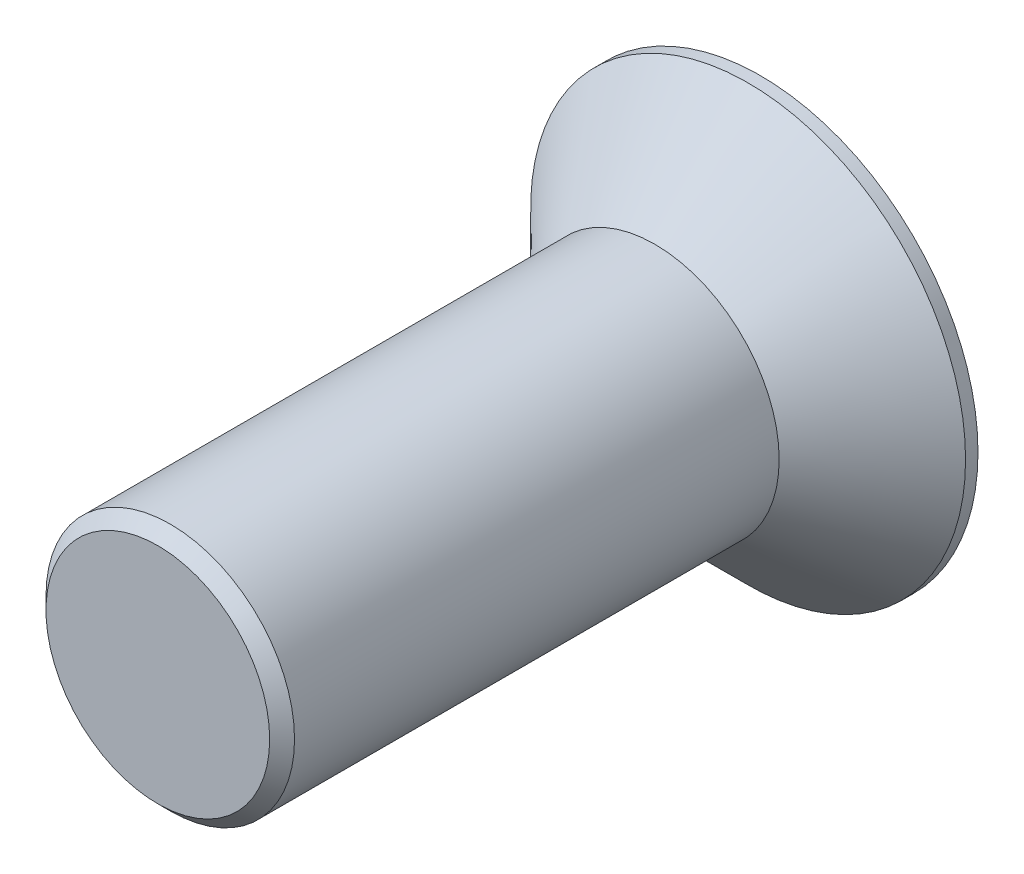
ISO-10303-21;
HEADER;
FILE_DESCRIPTION(('STEP AP214'),'2;1');
FILE_NAME('part.step','',(''),(''),'','','');
FILE_SCHEMA(('AUTOMOTIVE_DESIGN { 1 0 10303 214 1 1 1 1 }'));
ENDSEC;
DATA;
#1=APPLICATION_CONTEXT('core data for automotive mechanical design processes');
#2=APPLICATION_PROTOCOL_DEFINITION('international standard','automotive_design',2000,#1);
#3=PRODUCT_CONTEXT('',#1,'mechanical');
#4=PRODUCT('Part','Part','',(#3));
#5=PRODUCT_RELATED_PRODUCT_CATEGORY('part','',(#4));
#6=PRODUCT_DEFINITION_FORMATION('','',#4);
#7=PRODUCT_DEFINITION_CONTEXT('part definition',#1,'design');
#8=PRODUCT_DEFINITION('design','',#6,#7);
#9=PRODUCT_DEFINITION_SHAPE('','',#8);
#10=(LENGTH_UNIT() NAMED_UNIT(*) SI_UNIT(.MILLI.,.METRE.));
#11=(NAMED_UNIT(*) PLANE_ANGLE_UNIT() SI_UNIT($,.RADIAN.));
#12=(NAMED_UNIT(*) SI_UNIT($,.STERADIAN.) SOLID_ANGLE_UNIT());
#13=UNCERTAINTY_MEASURE_WITH_UNIT(LENGTH_MEASURE(1.E-05),#10,'distance_accuracy_value','');
#14=(GEOMETRIC_REPRESENTATION_CONTEXT(3) GLOBAL_UNCERTAINTY_ASSIGNED_CONTEXT((#13)) GLOBAL_UNIT_ASSIGNED_CONTEXT((#10,
#11,#12)) REPRESENTATION_CONTEXT('',''));
#15=CARTESIAN_POINT('',(0.,0.,0.));
#16=DIRECTION('',(0.,0.,1.));
#17=DIRECTION('',(1.,0.,0.));
#18=AXIS2_PLACEMENT_3D('',#15,#16,#17);
#19=CARTESIAN_POINT('',(0.,0.,8.));
#20=DIRECTION('',(0.,0.,-1.));
#21=DIRECTION('',(-1.,0.,0.));
#22=AXIS2_PLACEMENT_3D('',#19,#20,#21);
#23=CYLINDRICAL_SURFACE('',#22,2.);
#24=CARTESIAN_POINT('',(0.,0.,7.8));
#25=DIRECTION('',(0.,0.,1.));
#26=DIRECTION('',(1.,0.,0.));
#27=AXIS2_PLACEMENT_3D('',#24,#25,#26);
#28=CIRCLE('',#27,2.);
#29=CARTESIAN_POINT('',(2.,0.,7.8));
#30=VERTEX_POINT('',#29);
#31=EDGE_CURVE('E11',#30,#30,#28,.F.);
#32=ORIENTED_EDGE('',*,*,#31,.T.);
#33=EDGE_LOOP('',(#32));
#34=FACE_BOUND('',#33,.T.);
#35=CARTESIAN_POINT('',(0.,0.,0.));
#36=DIRECTION('',(0.,0.,1.));
#37=DIRECTION('',(1.,0.,0.));
#38=AXIS2_PLACEMENT_3D('',#35,#36,#37);
#39=CIRCLE('',#38,2.);
#40=CARTESIAN_POINT('',(2.,0.,0.));
#41=VERTEX_POINT('',#40);
#42=EDGE_CURVE('E119',#41,#41,#39,.T.);
#43=ORIENTED_EDGE('',*,*,#42,.T.);
#44=EDGE_LOOP('',(#43));
#45=FACE_BOUND('',#44,.T.);
#46=ADVANCED_FACE('F35',(#34,#45),#23,.T.);
#47=CARTESIAN_POINT('',(0.,0.,8.));
#48=DIRECTION('',(0.,0.,1.));
#49=DIRECTION('',(1.,0.,0.));
#50=AXIS2_PLACEMENT_3D('',#47,#48,#49);
#51=PLANE('',#50);
#52=CARTESIAN_POINT('',(0.,0.,8.));
#53=DIRECTION('',(0.,0.,1.));
#54=DIRECTION('',(1.,0.,0.));
#55=AXIS2_PLACEMENT_3D('',#52,#53,#54);
#56=CIRCLE('',#55,1.8);
#57=CARTESIAN_POINT('',(1.8,0.,8.));
#58=VERTEX_POINT('',#57);
#59=EDGE_CURVE('E43',#58,#58,#56,.T.);
#60=ORIENTED_EDGE('',*,*,#59,.T.);
#61=EDGE_LOOP('',(#60));
#62=FACE_BOUND('',#61,.T.);
#63=ADVANCED_FACE('F124',(#62),#51,.T.);
#64=CARTESIAN_POINT('',(0.,0.,8.));
#65=DIRECTION('',(0.,0.,-1.));
#66=DIRECTION('',(-1.,0.,0.));
#67=AXIS2_PLACEMENT_3D('',#64,#65,#66);
#68=CONICAL_SURFACE('',#67,1.8,0.785398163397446);
#69=ORIENTED_EDGE('',*,*,#31,.F.);
#70=EDGE_LOOP('',(#69));
#71=FACE_BOUND('',#70,.T.);
#72=ORIENTED_EDGE('',*,*,#59,.F.);
#73=EDGE_LOOP('',(#72));
#74=FACE_BOUND('',#73,.T.);
#75=ADVANCED_FACE('F37',(#71,#74),#68,.T.);
#76=CARTESIAN_POINT('',(0.,0.,-1.49999999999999));
#77=DIRECTION('',(0.,0.,-1.));
#78=DIRECTION('',(-1.,0.,0.));
#79=AXIS2_PLACEMENT_3D('',#76,#77,#78);
#80=CONICAL_SURFACE('',#79,3.5,0.78539816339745);
#81=ORIENTED_EDGE('',*,*,#42,.F.);
#82=EDGE_LOOP('',(#81));
#83=FACE_BOUND('',#82,.T.);
#84=CARTESIAN_POINT('',(0.,0.,-1.49999999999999));
#85=DIRECTION('',(0.,0.,1.));
#86=DIRECTION('',(1.,0.,0.));
#87=AXIS2_PLACEMENT_3D('',#84,#85,#86);
#88=CIRCLE('',#87,3.5);
#89=CARTESIAN_POINT('',(3.5,0.,-1.49999999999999));
#90=VERTEX_POINT('',#89);
#91=EDGE_CURVE('E116',#90,#90,#88,.T.);
#92=ORIENTED_EDGE('',*,*,#91,.T.);
#93=EDGE_LOOP('',(#92));
#94=FACE_BOUND('',#93,.T.);
#95=ADVANCED_FACE('F127',(#83,#94),#80,.T.);
#96=CARTESIAN_POINT('',(0.,0.,0.));
#97=DIRECTION('',(0.,0.,1.));
#98=DIRECTION('',(1.,0.,0.));
#99=AXIS2_PLACEMENT_3D('',#96,#97,#98);
#100=CYLINDRICAL_SURFACE('',#99,3.5);
#101=ORIENTED_EDGE('',*,*,#91,.F.);
#102=EDGE_LOOP('',(#101));
#103=FACE_BOUND('',#102,.T.);
#104=CARTESIAN_POINT('',(0.,0.,-1.69999999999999));
#105=DIRECTION('',(0.,0.,1.));
#106=DIRECTION('',(1.,0.,0.));
#107=AXIS2_PLACEMENT_3D('',#104,#105,#106);
#108=CIRCLE('',#107,3.5);
#109=CARTESIAN_POINT('',(3.5,0.,-1.69999999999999));
#110=VERTEX_POINT('',#109);
#111=EDGE_CURVE('E111',#110,#110,#108,.T.);
#112=ORIENTED_EDGE('',*,*,#111,.T.);
#113=EDGE_LOOP('',(#112));
#114=FACE_BOUND('',#113,.T.);
#115=ADVANCED_FACE('F133',(#103,#114),#100,.T.);
#116=CARTESIAN_POINT('',(-3.5,0.,-1.69999999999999));
#117=DIRECTION('',(0.,0.,1.));
#118=DIRECTION('',(1.,0.,0.));
#119=AXIS2_PLACEMENT_3D('',#116,#117,#118);
#120=PLANE('',#119);
#121=DIRECTION('',(1.,0.,0.));
#122=VECTOR('',#121,1.);
#123=CARTESIAN_POINT('',(0.25,3.10019943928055,-1.69999999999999));
#124=LINE('',#123,#122);
#125=CARTESIAN_POINT('',(-0.249999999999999,3.10019943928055,-1.69999999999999));
#126=VERTEX_POINT('',#125);
#127=CARTESIAN_POINT('',(0.25,3.10019943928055,-1.69999999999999));
#128=VERTEX_POINT('',#127);
#129=EDGE_CURVE('E85',#126,#128,#124,.T.);
#130=ORIENTED_EDGE('',*,*,#129,.F.);
#131=DIRECTION('',(0.,1.,0.));
#132=VECTOR('',#131,1.);
#133=CARTESIAN_POINT('',(-0.25,3.10019943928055,-1.69999999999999));
#134=LINE('',#133,#132);
#135=CARTESIAN_POINT('',(-0.25,-3.10019943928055,-1.69999999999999));
#136=VERTEX_POINT('',#135);
#137=EDGE_CURVE('E50',#136,#126,#134,.T.);
#138=ORIENTED_EDGE('',*,*,#137,.F.);
#139=DIRECTION('',(-1.,0.,0.));
#140=VECTOR('',#139,1.);
#141=CARTESIAN_POINT('',(0.25,-3.10019943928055,-1.69999999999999));
#142=LINE('',#141,#140);
#143=CARTESIAN_POINT('',(0.25,-3.10019943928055,-1.69999999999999));
#144=VERTEX_POINT('',#143);
#145=EDGE_CURVE('E101',#144,#136,#142,.T.);
#146=ORIENTED_EDGE('',*,*,#145,.F.);
#147=DIRECTION('',(0.,-1.,0.));
#148=VECTOR('',#147,1.);
#149=CARTESIAN_POINT('',(0.25,3.10019943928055,-1.69999999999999));
#150=LINE('',#149,#148);
#151=EDGE_CURVE('E107',#128,#144,#150,.T.);
#152=ORIENTED_EDGE('',*,*,#151,.F.);
#153=EDGE_LOOP('',(#130,#138,#146,#152));
#154=FACE_BOUND('',#153,.T.);
#155=ORIENTED_EDGE('',*,*,#111,.F.);
#156=EDGE_LOOP('',(#155));
#157=FACE_BOUND('',#156,.T.);
#158=ADVANCED_FACE('F146',(#154,#157),#120,.F.);
#159=CARTESIAN_POINT('',(-0.25,3.10019943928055,-1.19999999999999));
#160=DIRECTION('',(-1.,0.,0.));
#161=DIRECTION('',(0.,-1.,0.));
#162=AXIS2_PLACEMENT_3D('',#159,#160,#161);
#163=PLANE('',#162);
#164=ORIENTED_EDGE('',*,*,#137,.T.);
#165=DIRECTION('',(0.,0.,-1.));
#166=VECTOR('',#165,1.);
#167=CARTESIAN_POINT('',(-0.25,3.10019943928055,-1.19999999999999));
#168=LINE('',#167,#166);
#169=CARTESIAN_POINT('',(-0.25,3.10019943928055,-1.19999999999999));
#170=VERTEX_POINT('',#169);
#171=EDGE_CURVE('E73',#170,#126,#168,.T.);
#172=ORIENTED_EDGE('',*,*,#171,.F.);
#173=DIRECTION('',(0.,1.,0.));
#174=VECTOR('',#173,1.);
#175=CARTESIAN_POINT('',(-0.25,3.10019943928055,-1.19999999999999));
#176=LINE('',#175,#174);
#177=CARTESIAN_POINT('',(-0.25,-3.10019943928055,-1.19999999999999));
#178=VERTEX_POINT('',#177);
#179=EDGE_CURVE('E99',#178,#170,#176,.T.);
#180=ORIENTED_EDGE('',*,*,#179,.F.);
#181=DIRECTION('',(0.,0.,-1.));
#182=VECTOR('',#181,1.);
#183=CARTESIAN_POINT('',(-0.25,-3.10019943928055,-1.19999999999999));
#184=LINE('',#183,#182);
#185=EDGE_CURVE('E58',#178,#136,#184,.T.);
#186=ORIENTED_EDGE('',*,*,#185,.T.);
#187=EDGE_LOOP('',(#164,#172,#180,#186));
#188=FACE_BOUND('',#187,.T.);
#189=ADVANCED_FACE('F150',(#188),#163,.F.);
#190=CARTESIAN_POINT('',(0.25,-3.10019943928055,-1.19999999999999));
#191=DIRECTION('',(0.,-1.,0.));
#192=DIRECTION('',(0.,0.,-1.));
#193=AXIS2_PLACEMENT_3D('',#190,#191,#192);
#194=PLANE('',#193);
#195=ORIENTED_EDGE('',*,*,#145,.T.);
#196=ORIENTED_EDGE('',*,*,#185,.F.);
#197=DIRECTION('',(-1.,0.,0.));
#198=VECTOR('',#197,1.);
#199=CARTESIAN_POINT('',(0.25,-3.10019943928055,-1.19999999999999));
#200=LINE('',#199,#198);
#201=CARTESIAN_POINT('',(0.25,-3.10019943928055,-1.19999999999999));
#202=VERTEX_POINT('',#201);
#203=EDGE_CURVE('E96',#202,#178,#200,.T.);
#204=ORIENTED_EDGE('',*,*,#203,.F.);
#205=DIRECTION('',(0.,0.,-1.));
#206=VECTOR('',#205,1.);
#207=CARTESIAN_POINT('',(0.25,-3.10019943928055,-1.19999999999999));
#208=LINE('',#207,#206);
#209=EDGE_CURVE('E89',#202,#144,#208,.T.);
#210=ORIENTED_EDGE('',*,*,#209,.T.);
#211=EDGE_LOOP('',(#195,#196,#204,#210));
#212=FACE_BOUND('',#211,.T.);
#213=ADVANCED_FACE('F154',(#212),#194,.F.);
#214=CARTESIAN_POINT('',(0.25,3.10019943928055,-1.19999999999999));
#215=DIRECTION('',(1.,0.,0.));
#216=DIRECTION('',(0.,1.,0.));
#217=AXIS2_PLACEMENT_3D('',#214,#215,#216);
#218=PLANE('',#217);
#219=ORIENTED_EDGE('',*,*,#151,.T.);
#220=ORIENTED_EDGE('',*,*,#209,.F.);
#221=DIRECTION('',(0.,-1.,0.));
#222=VECTOR('',#221,1.);
#223=CARTESIAN_POINT('',(0.25,3.10019943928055,-1.19999999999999));
#224=LINE('',#223,#222);
#225=CARTESIAN_POINT('',(0.25,3.10019943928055,-1.19999999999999));
#226=VERTEX_POINT('',#225);
#227=EDGE_CURVE('E92',#226,#202,#224,.T.);
#228=ORIENTED_EDGE('',*,*,#227,.F.);
#229=DIRECTION('',(0.,0.,-1.));
#230=VECTOR('',#229,1.);
#231=CARTESIAN_POINT('',(0.25,3.10019943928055,-1.19999999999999));
#232=LINE('',#231,#230);
#233=EDGE_CURVE('E78',#226,#128,#232,.T.);
#234=ORIENTED_EDGE('',*,*,#233,.T.);
#235=EDGE_LOOP('',(#219,#220,#228,#234));
#236=FACE_BOUND('',#235,.T.);
#237=ADVANCED_FACE('F93',(#236),#218,.F.);
#238=CARTESIAN_POINT('',(0.25,3.10019943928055,-1.19999999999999));
#239=DIRECTION('',(0.,1.,0.));
#240=DIRECTION('',(0.,0.,1.));
#241=AXIS2_PLACEMENT_3D('',#238,#239,#240);
#242=PLANE('',#241);
#243=ORIENTED_EDGE('',*,*,#129,.T.);
#244=ORIENTED_EDGE('',*,*,#233,.F.);
#245=DIRECTION('',(1.,0.,0.));
#246=VECTOR('',#245,1.);
#247=CARTESIAN_POINT('',(0.25,3.10019943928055,-1.19999999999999));
#248=LINE('',#247,#246);
#249=EDGE_CURVE('E82',#170,#226,#248,.T.);
#250=ORIENTED_EDGE('',*,*,#249,.F.);
#251=ORIENTED_EDGE('',*,*,#171,.T.);
#252=EDGE_LOOP('',(#243,#244,#250,#251));
#253=FACE_BOUND('',#252,.T.);
#254=ADVANCED_FACE('F80',(#253),#242,.F.);
#255=CARTESIAN_POINT('',(-0.25,-3.10019943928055,-1.19999999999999));
#256=DIRECTION('',(0.,0.,-1.));
#257=DIRECTION('',(-1.,0.,0.));
#258=AXIS2_PLACEMENT_3D('',#255,#256,#257);
#259=PLANE('',#258);
#260=ORIENTED_EDGE('',*,*,#179,.T.);
#261=ORIENTED_EDGE('',*,*,#249,.T.);
#262=ORIENTED_EDGE('',*,*,#227,.T.);
#263=ORIENTED_EDGE('',*,*,#203,.T.);
#264=EDGE_LOOP('',(#260,#261,#262,#263));
#265=FACE_BOUND('',#264,.T.);
#266=ADVANCED_FACE('F98',(#265),#259,.T.);
#267=CLOSED_SHELL('',(#46,#63,#75,#95,#115,#158,#189,#213,#237,#254,#266));
#268=MANIFOLD_SOLID_BREP('B2',#267);
#269=ADVANCED_BREP_SHAPE_REPRESENTATION('',(#18,#268),#14);
#270=SHAPE_DEFINITION_REPRESENTATION(#9,#269);
ENDSEC;
END-ISO-10303-21;
